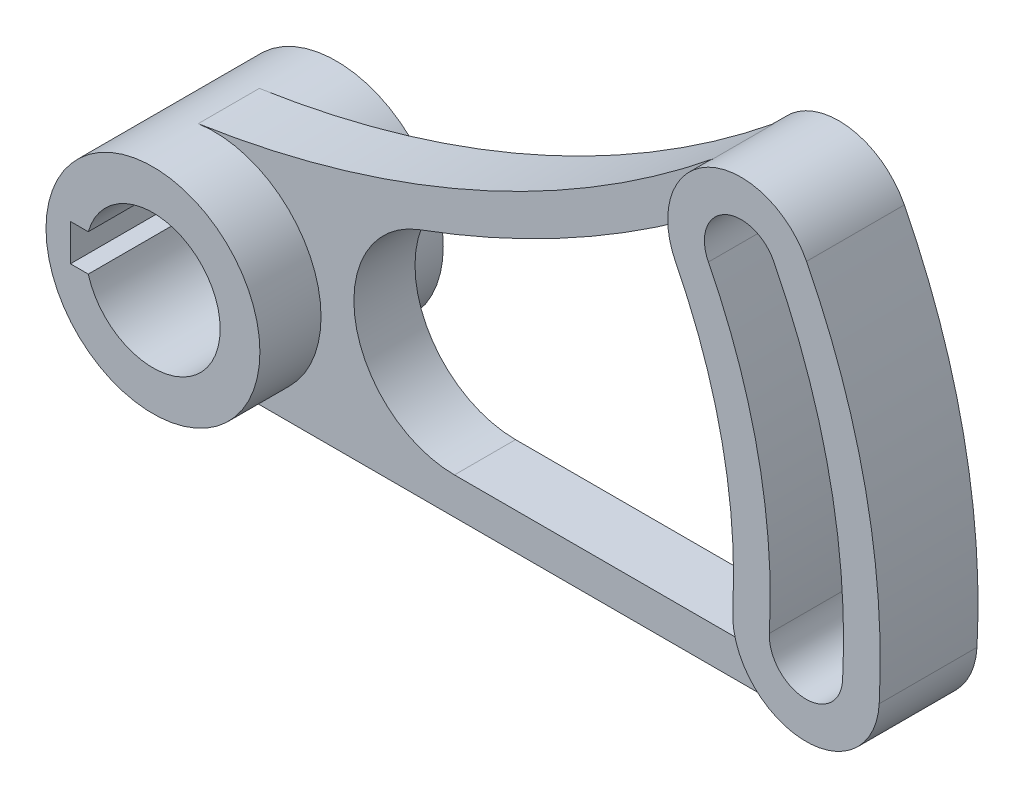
ISO-10303-21;
HEADER;
FILE_DESCRIPTION(('STEP AP214'),'2;1');
FILE_NAME('part.step','',(''),(''),'','','');
FILE_SCHEMA(('AUTOMOTIVE_DESIGN { 1 0 10303 214 1 1 1 1 }'));
ENDSEC;
DATA;
#1=APPLICATION_CONTEXT('core data for automotive mechanical design processes');
#2=APPLICATION_PROTOCOL_DEFINITION('international standard','automotive_design',2000,#1);
#3=PRODUCT_CONTEXT('',#1,'mechanical');
#4=PRODUCT('Part','Part','',(#3));
#5=PRODUCT_RELATED_PRODUCT_CATEGORY('part','',(#4));
#6=PRODUCT_DEFINITION_FORMATION('','',#4);
#7=PRODUCT_DEFINITION_CONTEXT('part definition',#1,'design');
#8=PRODUCT_DEFINITION('design','',#6,#7);
#9=PRODUCT_DEFINITION_SHAPE('','',#8);
#10=(LENGTH_UNIT() NAMED_UNIT(*) SI_UNIT(.MILLI.,.METRE.));
#11=(NAMED_UNIT(*) PLANE_ANGLE_UNIT() SI_UNIT($,.RADIAN.));
#12=(NAMED_UNIT(*) SI_UNIT($,.STERADIAN.) SOLID_ANGLE_UNIT());
#13=UNCERTAINTY_MEASURE_WITH_UNIT(LENGTH_MEASURE(1.E-05),#10,'distance_accuracy_value','');
#14=(GEOMETRIC_REPRESENTATION_CONTEXT(3) GLOBAL_UNCERTAINTY_ASSIGNED_CONTEXT((#13)) GLOBAL_UNIT_ASSIGNED_CONTEXT((#10,
#11,#12)) REPRESENTATION_CONTEXT('',''));
#15=CARTESIAN_POINT('',(0.,0.,0.));
#16=DIRECTION('',(0.,0.,1.));
#17=DIRECTION('',(1.,0.,0.));
#18=AXIS2_PLACEMENT_3D('',#15,#16,#17);
#19=CARTESIAN_POINT('',(0.,0.,15.));
#20=DIRECTION('',(0.,0.,-1.));
#21=DIRECTION('',(-1.,0.,0.));
#22=AXIS2_PLACEMENT_3D('',#19,#20,#21);
#23=CYLINDRICAL_SURFACE('',#22,11.);
#24=CARTESIAN_POINT('',(0.,0.,-15.));
#25=DIRECTION('',(0.,0.,1.));
#26=DIRECTION('',(1.,0.,0.));
#27=AXIS2_PLACEMENT_3D('',#24,#25,#26);
#28=CIRCLE('',#27,11.);
#29=CARTESIAN_POINT('',(-10.5830052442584,-3.,-15.));
#30=VERTEX_POINT('',#29);
#31=CARTESIAN_POINT('',(-10.5830052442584,3.,-15.));
#32=VERTEX_POINT('',#31);
#33=EDGE_CURVE('E298',#30,#32,#28,.T.);
#34=ORIENTED_EDGE('',*,*,#33,.F.);
#35=DIRECTION('',(0.,0.,-1.));
#36=VECTOR('',#35,1.);
#37=CARTESIAN_POINT('',(-10.5830052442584,-3.,15.));
#38=LINE('',#37,#36);
#39=CARTESIAN_POINT('',(-10.5830052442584,-3.,15.));
#40=VERTEX_POINT('',#39);
#41=EDGE_CURVE('E11',#40,#30,#38,.T.);
#42=ORIENTED_EDGE('',*,*,#41,.F.);
#43=CARTESIAN_POINT('',(0.,0.,15.));
#44=DIRECTION('',(0.,0.,1.));
#45=DIRECTION('',(1.,0.,0.));
#46=AXIS2_PLACEMENT_3D('',#43,#44,#45);
#47=CIRCLE('',#46,11.);
#48=CARTESIAN_POINT('',(-10.5830052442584,3.,15.));
#49=VERTEX_POINT('',#48);
#50=EDGE_CURVE('E299',#40,#49,#47,.T.);
#51=ORIENTED_EDGE('',*,*,#50,.T.);
#52=DIRECTION('',(0.,0.,-1.));
#53=VECTOR('',#52,1.);
#54=CARTESIAN_POINT('',(-10.5830052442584,3.,15.));
#55=LINE('',#54,#53);
#56=EDGE_CURVE('E319',#49,#32,#55,.T.);
#57=ORIENTED_EDGE('',*,*,#56,.T.);
#58=EDGE_LOOP('',(#34,#42,#51,#57));
#59=FACE_BOUND('',#58,.T.);
#60=ADVANCED_FACE('F38',(#59),#23,.F.);
#61=CARTESIAN_POINT('',(0.,-3.,15.));
#62=DIRECTION('',(0.,1.,0.));
#63=DIRECTION('',(0.,0.,1.));
#64=AXIS2_PLACEMENT_3D('',#61,#62,#63);
#65=PLANE('',#64);
#66=DIRECTION('',(1.,0.,0.));
#67=VECTOR('',#66,1.);
#68=CARTESIAN_POINT('',(0.,-3.,-15.));
#69=LINE('',#68,#67);
#70=CARTESIAN_POINT('',(-13.5,-3.,-15.));
#71=VERTEX_POINT('',#70);
#72=EDGE_CURVE('E323',#71,#30,#69,.T.);
#73=ORIENTED_EDGE('',*,*,#72,.F.);
#74=DIRECTION('',(0.,0.,-1.));
#75=VECTOR('',#74,1.);
#76=CARTESIAN_POINT('',(-13.5,-3.,15.));
#77=LINE('',#76,#75);
#78=CARTESIAN_POINT('',(-13.5,-3.,15.));
#79=VERTEX_POINT('',#78);
#80=EDGE_CURVE('E46',#79,#71,#77,.T.);
#81=ORIENTED_EDGE('',*,*,#80,.F.);
#82=DIRECTION('',(1.,0.,0.));
#83=VECTOR('',#82,1.);
#84=CARTESIAN_POINT('',(0.,-3.,15.));
#85=LINE('',#84,#83);
#86=EDGE_CURVE('E303',#79,#40,#85,.T.);
#87=ORIENTED_EDGE('',*,*,#86,.T.);
#88=ORIENTED_EDGE('',*,*,#41,.T.);
#89=EDGE_LOOP('',(#73,#81,#87,#88));
#90=FACE_BOUND('',#89,.T.);
#91=ADVANCED_FACE('F351',(#90),#65,.T.);
#92=CARTESIAN_POINT('',(-13.5,0.,15.));
#93=DIRECTION('',(1.,0.,0.));
#94=DIRECTION('',(0.,0.,-1.));
#95=AXIS2_PLACEMENT_3D('',#92,#93,#94);
#96=PLANE('',#95);
#97=DIRECTION('',(0.,-1.,0.));
#98=VECTOR('',#97,1.);
#99=CARTESIAN_POINT('',(-13.5,0.,-15.));
#100=LINE('',#99,#98);
#101=CARTESIAN_POINT('',(-13.5,3.,-15.));
#102=VERTEX_POINT('',#101);
#103=EDGE_CURVE('E327',#102,#71,#100,.T.);
#104=ORIENTED_EDGE('',*,*,#103,.F.);
#105=DIRECTION('',(0.,0.,-1.));
#106=VECTOR('',#105,1.);
#107=CARTESIAN_POINT('',(-13.5,3.,15.));
#108=LINE('',#107,#106);
#109=CARTESIAN_POINT('',(-13.5,3.,15.));
#110=VERTEX_POINT('',#109);
#111=EDGE_CURVE('E340',#110,#102,#108,.T.);
#112=ORIENTED_EDGE('',*,*,#111,.F.);
#113=DIRECTION('',(0.,-1.,0.));
#114=VECTOR('',#113,1.);
#115=CARTESIAN_POINT('',(-13.5,0.,15.));
#116=LINE('',#115,#114);
#117=EDGE_CURVE('E308',#110,#79,#116,.T.);
#118=ORIENTED_EDGE('',*,*,#117,.T.);
#119=ORIENTED_EDGE('',*,*,#80,.T.);
#120=EDGE_LOOP('',(#104,#112,#118,#119));
#121=FACE_BOUND('',#120,.T.);
#122=ADVANCED_FACE('F347',(#121),#96,.T.);
#123=CARTESIAN_POINT('',(0.,3.,15.));
#124=DIRECTION('',(0.,1.,0.));
#125=DIRECTION('',(0.,0.,1.));
#126=AXIS2_PLACEMENT_3D('',#123,#124,#125);
#127=PLANE('',#126);
#128=DIRECTION('',(1.,0.,0.));
#129=VECTOR('',#128,1.);
#130=CARTESIAN_POINT('',(0.,3.,-15.));
#131=LINE('',#130,#129);
#132=EDGE_CURVE('E331',#102,#32,#131,.T.);
#133=ORIENTED_EDGE('',*,*,#132,.T.);
#134=ORIENTED_EDGE('',*,*,#56,.F.);
#135=DIRECTION('',(1.,0.,0.));
#136=VECTOR('',#135,1.);
#137=CARTESIAN_POINT('',(0.,3.,15.));
#138=LINE('',#137,#136);
#139=EDGE_CURVE('E312',#110,#49,#138,.T.);
#140=ORIENTED_EDGE('',*,*,#139,.F.);
#141=ORIENTED_EDGE('',*,*,#111,.T.);
#142=EDGE_LOOP('',(#133,#134,#140,#141));
#143=FACE_BOUND('',#142,.T.);
#144=ADVANCED_FACE('F359',(#143),#127,.F.);
#145=CARTESIAN_POINT('',(0.,0.,15.));
#146=DIRECTION('',(0.,0.,-1.));
#147=DIRECTION('',(-1.,0.,0.));
#148=AXIS2_PLACEMENT_3D('',#145,#146,#147);
#149=CYLINDRICAL_SURFACE('',#148,17.5);
#150=DIRECTION('',(0.,0.,-1.));
#151=VECTOR('',#150,1.);
#152=CARTESIAN_POINT('',(0.,-17.5,5.));
#153=LINE('',#152,#151);
#154=CARTESIAN_POINT('',(0.,-17.5,5.));
#155=VERTEX_POINT('',#154);
#156=CARTESIAN_POINT('',(0.,-17.5,-5.));
#157=VERTEX_POINT('',#156);
#158=EDGE_CURVE('E58',#155,#157,#153,.T.);
#159=ORIENTED_EDGE('',*,*,#158,.F.);
#160=CARTESIAN_POINT('',(0.,0.,5.));
#161=DIRECTION('',(0.,0.,1.));
#162=DIRECTION('',(1.,0.,0.));
#163=AXIS2_PLACEMENT_3D('',#160,#161,#162);
#164=CIRCLE('',#163,17.5);
#165=CARTESIAN_POINT('',(-2.59842598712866,17.3060157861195,5.));
#166=VERTEX_POINT('',#165);
#167=EDGE_CURVE('E53',#155,#166,#164,.T.);
#168=ORIENTED_EDGE('',*,*,#167,.T.);
#169=DIRECTION('',(0.,0.,-1.));
#170=VECTOR('',#169,1.);
#171=CARTESIAN_POINT('',(-2.59842598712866,17.3060157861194,5.));
#172=LINE('',#171,#170);
#173=CARTESIAN_POINT('',(-2.59842598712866,17.3060157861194,-5.));
#174=VERTEX_POINT('',#173);
#175=EDGE_CURVE('E282',#166,#174,#172,.T.);
#176=ORIENTED_EDGE('',*,*,#175,.T.);
#177=CARTESIAN_POINT('',(0.,0.,-5.));
#178=DIRECTION('',(0.,0.,1.));
#179=DIRECTION('',(1.,0.,0.));
#180=AXIS2_PLACEMENT_3D('',#177,#178,#179);
#181=CIRCLE('',#180,17.5);
#182=EDGE_CURVE('E263',#157,#174,#181,.T.);
#183=ORIENTED_EDGE('',*,*,#182,.F.);
#184=EDGE_LOOP('',(#159,#168,#176,#183));
#185=FACE_BOUND('',#184,.T.);
#186=CARTESIAN_POINT('',(0.,0.,15.));
#187=DIRECTION('',(0.,0.,1.));
#188=DIRECTION('',(1.,0.,0.));
#189=AXIS2_PLACEMENT_3D('',#186,#187,#188);
#190=CIRCLE('',#189,17.5);
#191=CARTESIAN_POINT('',(17.5,0.,15.));
#192=VERTEX_POINT('',#191);
#193=EDGE_CURVE('E315',#192,#192,#190,.T.);
#194=ORIENTED_EDGE('',*,*,#193,.F.);
#195=EDGE_LOOP('',(#194));
#196=FACE_BOUND('',#195,.T.);
#197=CARTESIAN_POINT('',(0.,0.,-15.));
#198=DIRECTION('',(0.,0.,1.));
#199=DIRECTION('',(1.,0.,0.));
#200=AXIS2_PLACEMENT_3D('',#197,#198,#199);
#201=CIRCLE('',#200,17.5);
#202=CARTESIAN_POINT('',(17.5,0.,-15.));
#203=VERTEX_POINT('',#202);
#204=EDGE_CURVE('E304',#203,#203,#201,.T.);
#205=ORIENTED_EDGE('',*,*,#204,.T.);
#206=EDGE_LOOP('',(#205));
#207=FACE_BOUND('',#206,.T.);
#208=ADVANCED_FACE('F377',(#185,#196,#207),#149,.T.);
#209=CARTESIAN_POINT('',(0.,0.,15.));
#210=DIRECTION('',(0.,0.,1.));
#211=DIRECTION('',(1.,0.,0.));
#212=AXIS2_PLACEMENT_3D('',#209,#210,#211);
#213=PLANE('',#212);
#214=ORIENTED_EDGE('',*,*,#50,.F.);
#215=ORIENTED_EDGE('',*,*,#86,.F.);
#216=ORIENTED_EDGE('',*,*,#117,.F.);
#217=ORIENTED_EDGE('',*,*,#139,.T.);
#218=EDGE_LOOP('',(#214,#215,#216,#217));
#219=FACE_BOUND('',#218,.T.);
#220=ORIENTED_EDGE('',*,*,#193,.T.);
#221=EDGE_LOOP('',(#220));
#222=FACE_BOUND('',#221,.T.);
#223=ADVANCED_FACE('F363',(#219,#222),#213,.T.);
#224=CARTESIAN_POINT('',(0.,0.,-15.));
#225=DIRECTION('',(0.,0.,1.));
#226=DIRECTION('',(1.,0.,0.));
#227=AXIS2_PLACEMENT_3D('',#224,#225,#226);
#228=PLANE('',#227);
#229=ORIENTED_EDGE('',*,*,#33,.T.);
#230=ORIENTED_EDGE('',*,*,#132,.F.);
#231=ORIENTED_EDGE('',*,*,#103,.T.);
#232=ORIENTED_EDGE('',*,*,#72,.T.);
#233=EDGE_LOOP('',(#229,#230,#231,#232));
#234=FACE_BOUND('',#233,.T.);
#235=ORIENTED_EDGE('',*,*,#204,.F.);
#236=EDGE_LOOP('',(#235));
#237=FACE_BOUND('',#236,.T.);
#238=ADVANCED_FACE('F355',(#234,#237),#228,.F.);
#239=CARTESIAN_POINT('',(0.,-11.5,5.));
#240=DIRECTION('',(0.,1.,0.));
#241=DIRECTION('',(-1.,0.,0.));
#242=AXIS2_PLACEMENT_3D('',#239,#240,#241);
#243=PLANE('',#242);
#244=DIRECTION('',(1.,0.,0.));
#245=VECTOR('',#244,1.);
#246=CARTESIAN_POINT('',(0.,-11.5,-5.));
#247=LINE('',#246,#245);
#248=CARTESIAN_POINT('',(39.3305378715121,-11.5,-5.));
#249=VERTEX_POINT('',#248);
#250=CARTESIAN_POINT('',(89.4447864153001,-11.5,-5.));
#251=VERTEX_POINT('',#250);
#252=EDGE_CURVE('E242',#249,#251,#247,.T.);
#253=ORIENTED_EDGE('',*,*,#252,.F.);
#254=DIRECTION('',(0.,0.,-1.));
#255=VECTOR('',#254,1.);
#256=CARTESIAN_POINT('',(39.3305378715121,-11.5,5.));
#257=LINE('',#256,#255);
#258=CARTESIAN_POINT('',(39.3305378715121,-11.5,5.));
#259=VERTEX_POINT('',#258);
#260=EDGE_CURVE('E295',#259,#249,#257,.T.);
#261=ORIENTED_EDGE('',*,*,#260,.F.);
#262=DIRECTION('',(1.,0.,0.));
#263=VECTOR('',#262,1.);
#264=CARTESIAN_POINT('',(0.,-11.5,5.));
#265=LINE('',#264,#263);
#266=CARTESIAN_POINT('',(89.4447864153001,-11.5,5.));
#267=VERTEX_POINT('',#266);
#268=EDGE_CURVE('E214',#259,#267,#265,.T.);
#269=ORIENTED_EDGE('',*,*,#268,.T.);
#270=DIRECTION('',(0.,0.,-1.));
#271=VECTOR('',#270,1.);
#272=CARTESIAN_POINT('',(89.4447864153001,-11.5,5.));
#273=LINE('',#272,#271);
#274=EDGE_CURVE('E241',#267,#251,#273,.T.);
#275=ORIENTED_EDGE('',*,*,#274,.T.);
#276=EDGE_LOOP('',(#253,#261,#269,#275));
#277=FACE_BOUND('',#276,.T.);
#278=ADVANCED_FACE('F382',(#277),#243,.T.);
#279=CARTESIAN_POINT('',(39.3305378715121,4.95634805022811,5.));
#280=DIRECTION('',(0.,0.,-1.));
#281=DIRECTION('',(-1.,0.,0.));
#282=AXIS2_PLACEMENT_3D('',#279,#280,#281);
#283=CYLINDRICAL_SURFACE('',#282,16.4563480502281);
#284=CARTESIAN_POINT('',(39.3305378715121,4.95634805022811,-5.));
#285=DIRECTION('',(0.,0.,1.));
#286=DIRECTION('',(1.,0.,0.));
#287=AXIS2_PLACEMENT_3D('',#284,#285,#286);
#288=CIRCLE('',#287,16.4563480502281);
#289=CARTESIAN_POINT('',(33.6705342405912,20.4087184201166,-5.));
#290=VERTEX_POINT('',#289);
#291=EDGE_CURVE('E246',#249,#290,#288,.F.);
#292=ORIENTED_EDGE('',*,*,#291,.T.);
#293=DIRECTION('',(0.,0.,-1.));
#294=VECTOR('',#293,1.);
#295=CARTESIAN_POINT('',(33.6705342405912,20.4087184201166,5.));
#296=LINE('',#295,#294);
#297=CARTESIAN_POINT('',(33.6705342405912,20.4087184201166,5.));
#298=VERTEX_POINT('',#297);
#299=EDGE_CURVE('E292',#298,#290,#296,.T.);
#300=ORIENTED_EDGE('',*,*,#299,.F.);
#301=CARTESIAN_POINT('',(39.3305378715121,4.95634805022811,5.));
#302=DIRECTION('',(0.,0.,1.));
#303=DIRECTION('',(1.,0.,0.));
#304=AXIS2_PLACEMENT_3D('',#301,#302,#303);
#305=CIRCLE('',#304,16.4563480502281);
#306=EDGE_CURVE('E218',#259,#298,#305,.F.);
#307=ORIENTED_EDGE('',*,*,#306,.F.);
#308=ORIENTED_EDGE('',*,*,#260,.T.);
#309=EDGE_LOOP('',(#292,#300,#307,#308));
#310=FACE_BOUND('',#309,.T.);
#311=ADVANCED_FACE('F387',(#310),#283,.F.);
#312=CARTESIAN_POINT('',(-28.5826858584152,190.366173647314,5.));
#313=DIRECTION('',(0.,0.,-1.));
#314=DIRECTION('',(-1.,0.,0.));
#315=AXIS2_PLACEMENT_3D('',#312,#313,#314);
#316=CYLINDRICAL_SURFACE('',#315,181.);
#317=CARTESIAN_POINT('',(-28.5826858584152,190.366173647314,-5.));
#318=DIRECTION('',(0.,0.,1.));
#319=DIRECTION('',(1.,0.,0.));
#320=AXIS2_PLACEMENT_3D('',#317,#318,#319);
#321=CIRCLE('',#320,181.);
#322=CARTESIAN_POINT('',(77.3309090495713,43.5897776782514,-5.));
#323=VERTEX_POINT('',#322);
#324=EDGE_CURVE('E251',#323,#290,#321,.F.);
#325=ORIENTED_EDGE('',*,*,#324,.F.);
#326=DIRECTION('',(0.,0.,-1.));
#327=VECTOR('',#326,1.);
#328=CARTESIAN_POINT('',(77.3309090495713,43.5897776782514,5.));
#329=LINE('',#328,#327);
#330=CARTESIAN_POINT('',(77.3309090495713,43.5897776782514,5.));
#331=VERTEX_POINT('',#330);
#332=EDGE_CURVE('E289',#331,#323,#329,.T.);
#333=ORIENTED_EDGE('',*,*,#332,.F.);
#334=CARTESIAN_POINT('',(-28.5826858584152,190.366173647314,5.));
#335=DIRECTION('',(0.,0.,1.));
#336=DIRECTION('',(1.,0.,0.));
#337=AXIS2_PLACEMENT_3D('',#334,#335,#336);
#338=CIRCLE('',#337,181.);
#339=EDGE_CURVE('E222',#331,#298,#338,.F.);
#340=ORIENTED_EDGE('',*,*,#339,.T.);
#341=ORIENTED_EDGE('',*,*,#299,.T.);
#342=EDGE_LOOP('',(#325,#333,#340,#341));
#343=FACE_BOUND('',#342,.T.);
#344=ADVANCED_FACE('F391',(#343),#316,.T.);
#345=CARTESIAN_POINT('',(-28.5826858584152,190.366173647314,5.));
#346=DIRECTION('',(0.,0.,-1.));
#347=DIRECTION('',(-1.,0.,0.));
#348=AXIS2_PLACEMENT_3D('',#345,#346,#347);
#349=CYLINDRICAL_SURFACE('',#348,175.);
#350=CARTESIAN_POINT('',(-28.5826858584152,190.366173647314,-5.));
#351=DIRECTION('',(0.,0.,1.));
#352=DIRECTION('',(1.,0.,0.));
#353=AXIS2_PLACEMENT_3D('',#350,#351,#352);
#354=CIRCLE('',#353,175.);
#355=CARTESIAN_POINT('',(81.6695689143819,54.4638546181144,-5.));
#356=VERTEX_POINT('',#355);
#357=EDGE_CURVE('E259',#356,#174,#354,.F.);
#358=ORIENTED_EDGE('',*,*,#357,.T.);
#359=ORIENTED_EDGE('',*,*,#175,.F.);
#360=CARTESIAN_POINT('',(-28.5826858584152,190.366173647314,5.));
#361=DIRECTION('',(0.,0.,1.));
#362=DIRECTION('',(1.,0.,0.));
#363=AXIS2_PLACEMENT_3D('',#360,#361,#362);
#364=CIRCLE('',#363,175.);
#365=CARTESIAN_POINT('',(81.669568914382,54.4638546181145,5.));
#366=VERTEX_POINT('',#365);
#367=EDGE_CURVE('E229',#366,#166,#364,.F.);
#368=ORIENTED_EDGE('',*,*,#367,.F.);
#369=DIRECTION('',(0.,0.,-1.));
#370=VECTOR('',#369,1.);
#371=CARTESIAN_POINT('',(81.6695689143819,54.4638546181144,5.));
#372=LINE('',#371,#370);
#373=EDGE_CURVE('E285',#366,#356,#372,.T.);
#374=ORIENTED_EDGE('',*,*,#373,.T.);
#375=EDGE_LOOP('',(#358,#359,#368,#374));
#376=FACE_BOUND('',#375,.T.);
#377=ADVANCED_FACE('F395',(#376),#349,.F.);
#378=CARTESIAN_POINT('',(0.,-17.5,5.));
#379=DIRECTION('',(0.,1.,0.));
#380=DIRECTION('',(0.,0.,1.));
#381=AXIS2_PLACEMENT_3D('',#378,#379,#380);
#382=PLANE('',#381);
#383=DIRECTION('',(1.,0.,0.));
#384=VECTOR('',#383,1.);
#385=CARTESIAN_POINT('',(0.,-17.5,-5.));
#386=LINE('',#385,#384);
#387=CARTESIAN_POINT('',(99.1854323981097,-17.5,-5.));
#388=VERTEX_POINT('',#387);
#389=EDGE_CURVE('E267',#157,#388,#386,.T.);
#390=ORIENTED_EDGE('',*,*,#389,.T.);
#391=DIRECTION('',(0.,0.,-1.));
#392=VECTOR('',#391,1.);
#393=CARTESIAN_POINT('',(99.1854323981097,-17.5,5.));
#394=LINE('',#393,#392);
#395=CARTESIAN_POINT('',(99.1854323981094,-17.5,5.));
#396=VERTEX_POINT('',#395);
#397=EDGE_CURVE('E277',#396,#388,#394,.T.);
#398=ORIENTED_EDGE('',*,*,#397,.F.);
#399=DIRECTION('',(1.,0.,0.));
#400=VECTOR('',#399,1.);
#401=CARTESIAN_POINT('',(0.,-17.5,5.));
#402=LINE('',#401,#400);
#403=EDGE_CURVE('E234',#155,#396,#402,.T.);
#404=ORIENTED_EDGE('',*,*,#403,.F.);
#405=ORIENTED_EDGE('',*,*,#158,.T.);
#406=EDGE_LOOP('',(#390,#398,#404,#405));
#407=FACE_BOUND('',#406,.T.);
#408=ADVANCED_FACE('F399',(#407),#382,.F.);
#409=CARTESIAN_POINT('',(0.,0.,5.));
#410=DIRECTION('',(0.,0.,1.));
#411=DIRECTION('',(1.,0.,0.));
#412=AXIS2_PLACEMENT_3D('',#409,#410,#411);
#413=PLANE('',#412);
#414=ORIENTED_EDGE('',*,*,#268,.F.);
#415=ORIENTED_EDGE('',*,*,#306,.T.);
#416=ORIENTED_EDGE('',*,*,#339,.F.);
#417=CARTESIAN_POINT('',(89.2297235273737,45.1448384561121,5.));
#418=DIRECTION('',(0.,0.,1.));
#419=DIRECTION('',(1.,0.,0.));
#420=AXIS2_PLACEMENT_3D('',#417,#418,#419);
#421=CIRCLE('',#420,12.);
#422=EDGE_CURVE('E226',#366,#331,#421,.T.);
#423=ORIENTED_EDGE('',*,*,#422,.F.);
#424=ORIENTED_EDGE('',*,*,#367,.T.);
#425=ORIENTED_EDGE('',*,*,#167,.F.);
#426=ORIENTED_EDGE('',*,*,#403,.T.);
#427=CARTESIAN_POINT('',(99.8476265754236,-5.51828481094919,5.));
#428=DIRECTION('',(0.,0.,1.));
#429=DIRECTION('',(1.,0.,0.));
#430=AXIS2_PLACEMENT_3D('',#427,#428,#429);
#431=CIRCLE('',#430,12.);
#432=EDGE_CURVE('E238',#267,#396,#431,.T.);
#433=ORIENTED_EDGE('',*,*,#432,.F.);
#434=EDGE_LOOP('',(#414,#415,#416,#423,#424,#425,#426,#433));
#435=FACE_BOUND('',#434,.T.);
#436=ADVANCED_FACE('F403',(#435),#413,.T.);
#437=CARTESIAN_POINT('',(0.,0.,-5.));
#438=DIRECTION('',(0.,0.,1.));
#439=DIRECTION('',(1.,0.,0.));
#440=AXIS2_PLACEMENT_3D('',#437,#438,#439);
#441=PLANE('',#440);
#442=ORIENTED_EDGE('',*,*,#252,.T.);
#443=CARTESIAN_POINT('',(99.8476265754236,-5.51828481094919,-5.));
#444=DIRECTION('',(0.,0.,1.));
#445=DIRECTION('',(1.,0.,0.));
#446=AXIS2_PLACEMENT_3D('',#443,#444,#445);
#447=CIRCLE('',#446,12.);
#448=EDGE_CURVE('E219',#251,#388,#447,.T.);
#449=ORIENTED_EDGE('',*,*,#448,.T.);
#450=ORIENTED_EDGE('',*,*,#389,.F.);
#451=ORIENTED_EDGE('',*,*,#182,.T.);
#452=ORIENTED_EDGE('',*,*,#357,.F.);
#453=CARTESIAN_POINT('',(89.2297235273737,45.1448384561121,-5.));
#454=DIRECTION('',(0.,0.,1.));
#455=DIRECTION('',(1.,0.,0.));
#456=AXIS2_PLACEMENT_3D('',#453,#454,#455);
#457=CIRCLE('',#456,12.);
#458=EDGE_CURVE('E255',#356,#323,#457,.T.);
#459=ORIENTED_EDGE('',*,*,#458,.T.);
#460=ORIENTED_EDGE('',*,*,#324,.T.);
#461=ORIENTED_EDGE('',*,*,#291,.F.);
#462=EDGE_LOOP('',(#442,#449,#450,#451,#452,#459,#460,#461));
#463=FACE_BOUND('',#462,.T.);
#464=ADVANCED_FACE('F405',(#463),#441,.F.);
#465=CARTESIAN_POINT('',(99.8476265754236,-5.51828481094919,8.));
#466=DIRECTION('',(0.,0.,-1.));
#467=DIRECTION('',(-1.,0.,0.));
#468=AXIS2_PLACEMENT_3D('',#465,#466,#467);
#469=CYLINDRICAL_SURFACE('',#468,5.99999999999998);
#470=CARTESIAN_POINT('',(99.8476265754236,-5.51828481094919,-8.));
#471=DIRECTION('',(0.,0.,1.));
#472=DIRECTION('',(1.,0.,0.));
#473=AXIS2_PLACEMENT_3D('',#470,#471,#472);
#474=CIRCLE('',#473,5.99999999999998);
#475=CARTESIAN_POINT('',(93.8567689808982,-5.1871877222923,-8.));
#476=VERTEX_POINT('',#475);
#477=CARTESIAN_POINT('',(105.838484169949,-5.84938189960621,-8.));
#478=VERTEX_POINT('',#477);
#479=EDGE_CURVE('E640',#476,#478,#474,.T.);
#480=ORIENTED_EDGE('',*,*,#479,.F.);
#481=DIRECTION('',(0.,0.,-1.));
#482=VECTOR('',#481,1.);
#483=CARTESIAN_POINT('',(93.8567689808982,-5.1871877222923,8.));
#484=LINE('',#483,#482);
#485=CARTESIAN_POINT('',(93.8567689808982,-5.1871877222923,8.));
#486=VERTEX_POINT('',#485);
#487=EDGE_CURVE('E247',#486,#476,#484,.T.);
#488=ORIENTED_EDGE('',*,*,#487,.F.);
#489=CARTESIAN_POINT('',(99.8476265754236,-5.51828481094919,8.));
#490=DIRECTION('',(0.,0.,1.));
#491=DIRECTION('',(1.,0.,0.));
#492=AXIS2_PLACEMENT_3D('',#489,#490,#491);
#493=CIRCLE('',#492,5.99999999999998);
#494=CARTESIAN_POINT('',(105.838484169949,-5.84938189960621,8.));
#495=VERTEX_POINT('',#494);
#496=EDGE_CURVE('E699',#486,#495,#493,.T.);
#497=ORIENTED_EDGE('',*,*,#496,.T.);
#498=DIRECTION('',(0.,0.,-1.));
#499=VECTOR('',#498,1.);
#500=CARTESIAN_POINT('',(105.838484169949,-5.84938189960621,8.));
#501=LINE('',#500,#499);
#502=EDGE_CURVE('E203',#495,#478,#501,.T.);
#503=ORIENTED_EDGE('',*,*,#502,.T.);
#504=EDGE_LOOP('',(#480,#488,#497,#503));
#505=FACE_BOUND('',#504,.T.);
#506=ADVANCED_FACE('F408',(#505),#469,.F.);
#507=CARTESIAN_POINT('',(0.,0.,8.));
#508=DIRECTION('',(0.,0.,-1.));
#509=DIRECTION('',(-1.,0.,0.));
#510=AXIS2_PLACEMENT_3D('',#507,#508,#509);
#511=CYLINDRICAL_SURFACE('',#510,94.);
#512=CARTESIAN_POINT('',(0.,0.,-8.));
#513=DIRECTION('',(0.,0.,1.));
#514=DIRECTION('',(1.,0.,0.));
#515=AXIS2_PLACEMENT_3D('',#512,#513,#514);
#516=CIRCLE('',#515,94.);
#517=CARTESIAN_POINT('',(83.8759401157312,42.4361481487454,-8.));
#518=VERTEX_POINT('',#517);
#519=EDGE_CURVE('E644',#476,#518,#516,.T.);
#520=ORIENTED_EDGE('',*,*,#519,.T.);
#521=DIRECTION('',(0.,0.,-1.));
#522=VECTOR('',#521,1.);
#523=CARTESIAN_POINT('',(83.8759401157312,42.4361481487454,8.));
#524=LINE('',#523,#522);
#525=CARTESIAN_POINT('',(83.8759401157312,42.4361481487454,8.));
#526=VERTEX_POINT('',#525);
#527=EDGE_CURVE('E661',#526,#518,#524,.T.);
#528=ORIENTED_EDGE('',*,*,#527,.F.);
#529=CARTESIAN_POINT('',(0.,0.,8.));
#530=DIRECTION('',(0.,0.,1.));
#531=DIRECTION('',(1.,0.,0.));
#532=AXIS2_PLACEMENT_3D('',#529,#530,#531);
#533=CIRCLE('',#532,94.);
#534=EDGE_CURVE('E693',#486,#526,#533,.T.);
#535=ORIENTED_EDGE('',*,*,#534,.F.);
#536=ORIENTED_EDGE('',*,*,#487,.T.);
#537=EDGE_LOOP('',(#520,#528,#535,#536));
#538=FACE_BOUND('',#537,.T.);
#539=ADVANCED_FACE('F430',(#538),#511,.T.);
#540=CARTESIAN_POINT('',(89.2297235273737,45.1448384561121,8.));
#541=DIRECTION('',(0.,0.,-1.));
#542=DIRECTION('',(-1.,0.,0.));
#543=AXIS2_PLACEMENT_3D('',#540,#541,#542);
#544=CYLINDRICAL_SURFACE('',#543,6.);
#545=CARTESIAN_POINT('',(89.2297235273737,45.1448384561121,-8.));
#546=DIRECTION('',(0.,0.,1.));
#547=DIRECTION('',(1.,0.,0.));
#548=AXIS2_PLACEMENT_3D('',#545,#546,#547);
#549=CIRCLE('',#548,6.);
#550=CARTESIAN_POINT('',(94.583506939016,47.8535287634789,-8.));
#551=VERTEX_POINT('',#550);
#552=EDGE_CURVE('E652',#551,#518,#549,.T.);
#553=ORIENTED_EDGE('',*,*,#552,.F.);
#554=DIRECTION('',(0.,0.,-1.));
#555=VECTOR('',#554,1.);
#556=CARTESIAN_POINT('',(94.583506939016,47.8535287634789,8.));
#557=LINE('',#556,#555);
#558=CARTESIAN_POINT('',(94.583506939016,47.8535287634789,8.));
#559=VERTEX_POINT('',#558);
#560=EDGE_CURVE('E208',#559,#551,#557,.T.);
#561=ORIENTED_EDGE('',*,*,#560,.F.);
#562=CARTESIAN_POINT('',(89.2297235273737,45.1448384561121,8.));
#563=DIRECTION('',(0.,0.,1.));
#564=DIRECTION('',(1.,0.,0.));
#565=AXIS2_PLACEMENT_3D('',#562,#563,#564);
#566=CIRCLE('',#565,6.);
#567=EDGE_CURVE('E690',#559,#526,#566,.T.);
#568=ORIENTED_EDGE('',*,*,#567,.T.);
#569=ORIENTED_EDGE('',*,*,#527,.T.);
#570=EDGE_LOOP('',(#553,#561,#568,#569));
#571=FACE_BOUND('',#570,.T.);
#572=ADVANCED_FACE('F415',(#571),#544,.F.);
#573=CARTESIAN_POINT('',(0.,0.,8.));
#574=DIRECTION('',(0.,0.,-1.));
#575=DIRECTION('',(-1.,0.,0.));
#576=AXIS2_PLACEMENT_3D('',#573,#574,#575);
#577=CYLINDRICAL_SURFACE('',#576,112.);
#578=CARTESIAN_POINT('',(0.,0.,-8.));
#579=DIRECTION('',(0.,0.,1.));
#580=DIRECTION('',(1.,0.,0.));
#581=AXIS2_PLACEMENT_3D('',#578,#579,#580);
#582=CIRCLE('',#581,112.);
#583=CARTESIAN_POINT('',(111.829341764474,-6.18047898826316,-8.));
#584=VERTEX_POINT('',#583);
#585=CARTESIAN_POINT('',(99.9372903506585,50.5622190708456,-8.));
#586=VERTEX_POINT('',#585);
#587=EDGE_CURVE('E201',#584,#586,#582,.T.);
#588=ORIENTED_EDGE('',*,*,#587,.T.);
#589=DIRECTION('',(0.,0.,-1.));
#590=VECTOR('',#589,1.);
#591=CARTESIAN_POINT('',(99.9372903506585,50.5622190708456,8.));
#592=LINE('',#591,#590);
#593=CARTESIAN_POINT('',(99.9372903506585,50.5622190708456,8.));
#594=VERTEX_POINT('',#593);
#595=EDGE_CURVE('E178',#594,#586,#592,.T.);
#596=ORIENTED_EDGE('',*,*,#595,.F.);
#597=CARTESIAN_POINT('',(0.,0.,8.));
#598=DIRECTION('',(0.,0.,1.));
#599=DIRECTION('',(1.,0.,0.));
#600=AXIS2_PLACEMENT_3D('',#597,#598,#599);
#601=CIRCLE('',#600,112.);
#602=CARTESIAN_POINT('',(111.829341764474,-6.18047898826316,8.));
#603=VERTEX_POINT('',#602);
#604=EDGE_CURVE('E186',#603,#594,#601,.T.);
#605=ORIENTED_EDGE('',*,*,#604,.F.);
#606=DIRECTION('',(0.,0.,-1.));
#607=VECTOR('',#606,1.);
#608=CARTESIAN_POINT('',(111.829341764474,-6.18047898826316,8.));
#609=LINE('',#608,#607);
#610=EDGE_CURVE('E666',#603,#584,#609,.T.);
#611=ORIENTED_EDGE('',*,*,#610,.T.);
#612=EDGE_LOOP('',(#588,#596,#605,#611));
#613=FACE_BOUND('',#612,.T.);
#614=ADVANCED_FACE('F199',(#613),#577,.T.);
#615=CARTESIAN_POINT('',(89.2297235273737,45.1448384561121,8.));
#616=DIRECTION('',(0.,0.,-1.));
#617=DIRECTION('',(-1.,0.,0.));
#618=AXIS2_PLACEMENT_3D('',#615,#616,#617);
#619=CYLINDRICAL_SURFACE('',#618,12.);
#620=ORIENTED_EDGE('',*,*,#422,.T.);
#621=ORIENTED_EDGE('',*,*,#332,.T.);
#622=ORIENTED_EDGE('',*,*,#458,.F.);
#623=ORIENTED_EDGE('',*,*,#373,.F.);
#624=EDGE_LOOP('',(#620,#621,#622,#623));
#625=FACE_BOUND('',#624,.T.);
#626=CARTESIAN_POINT('',(89.2297235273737,45.1448384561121,-8.));
#627=DIRECTION('',(0.,0.,1.));
#628=DIRECTION('',(1.,0.,0.));
#629=AXIS2_PLACEMENT_3D('',#626,#627,#628);
#630=CIRCLE('',#629,12.);
#631=CARTESIAN_POINT('',(78.5221567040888,39.7274578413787,-8.));
#632=VERTEX_POINT('',#631);
#633=EDGE_CURVE('E678',#586,#632,#630,.T.);
#634=ORIENTED_EDGE('',*,*,#633,.T.);
#635=DIRECTION('',(0.,0.,-1.));
#636=VECTOR('',#635,1.);
#637=CARTESIAN_POINT('',(78.5221567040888,39.7274578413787,8.));
#638=LINE('',#637,#636);
#639=CARTESIAN_POINT('',(78.5221567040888,39.7274578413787,8.));
#640=VERTEX_POINT('',#639);
#641=EDGE_CURVE('E180',#640,#632,#638,.T.);
#642=ORIENTED_EDGE('',*,*,#641,.F.);
#643=CARTESIAN_POINT('',(89.2297235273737,45.1448384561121,8.));
#644=DIRECTION('',(0.,0.,1.));
#645=DIRECTION('',(1.,0.,0.));
#646=AXIS2_PLACEMENT_3D('',#643,#644,#645);
#647=CIRCLE('',#646,12.);
#648=EDGE_CURVE('E173',#594,#640,#647,.T.);
#649=ORIENTED_EDGE('',*,*,#648,.F.);
#650=ORIENTED_EDGE('',*,*,#595,.T.);
#651=EDGE_LOOP('',(#634,#642,#649,#650));
#652=FACE_BOUND('',#651,.T.);
#653=ADVANCED_FACE('F176',(#625,#652),#619,.T.);
#654=CARTESIAN_POINT('',(0.,0.,8.));
#655=DIRECTION('',(0.,0.,-1.));
#656=DIRECTION('',(-1.,0.,0.));
#657=AXIS2_PLACEMENT_3D('',#654,#655,#656);
#658=CYLINDRICAL_SURFACE('',#657,88.);
#659=CARTESIAN_POINT('',(0.,0.,-8.));
#660=DIRECTION('',(0.,0.,1.));
#661=DIRECTION('',(1.,0.,0.));
#662=AXIS2_PLACEMENT_3D('',#659,#660,#661);
#663=CIRCLE('',#662,88.);
#664=CARTESIAN_POINT('',(87.8659113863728,-4.85609063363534,-8.));
#665=VERTEX_POINT('',#664);
#666=EDGE_CURVE('E674',#665,#632,#663,.T.);
#667=ORIENTED_EDGE('',*,*,#666,.F.);
#668=DIRECTION('',(0.,0.,-1.));
#669=VECTOR('',#668,1.);
#670=CARTESIAN_POINT('',(87.8659113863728,-4.85609063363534,8.));
#671=LINE('',#670,#669);
#672=CARTESIAN_POINT('',(87.8659113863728,-4.85609063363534,8.));
#673=VERTEX_POINT('',#672);
#674=EDGE_CURVE('E210',#673,#665,#671,.T.);
#675=ORIENTED_EDGE('',*,*,#674,.F.);
#676=CARTESIAN_POINT('',(0.,0.,8.));
#677=DIRECTION('',(0.,0.,1.));
#678=DIRECTION('',(1.,0.,0.));
#679=AXIS2_PLACEMENT_3D('',#676,#677,#678);
#680=CIRCLE('',#679,88.);
#681=EDGE_CURVE('E185',#673,#640,#680,.T.);
#682=ORIENTED_EDGE('',*,*,#681,.T.);
#683=ORIENTED_EDGE('',*,*,#641,.T.);
#684=EDGE_LOOP('',(#667,#675,#682,#683));
#685=FACE_BOUND('',#684,.T.);
#686=ADVANCED_FACE('F418',(#685),#658,.F.);
#687=CARTESIAN_POINT('',(99.8476265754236,-5.51828481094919,8.));
#688=DIRECTION('',(0.,0.,-1.));
#689=DIRECTION('',(-1.,0.,0.));
#690=AXIS2_PLACEMENT_3D('',#687,#688,#689);
#691=CYLINDRICAL_SURFACE('',#690,12.);
#692=ORIENTED_EDGE('',*,*,#432,.T.);
#693=ORIENTED_EDGE('',*,*,#397,.T.);
#694=ORIENTED_EDGE('',*,*,#448,.F.);
#695=ORIENTED_EDGE('',*,*,#274,.F.);
#696=EDGE_LOOP('',(#692,#693,#694,#695));
#697=FACE_BOUND('',#696,.T.);
#698=CARTESIAN_POINT('',(99.8476265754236,-5.51828481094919,-8.));
#699=DIRECTION('',(0.,0.,1.));
#700=DIRECTION('',(1.,0.,0.));
#701=AXIS2_PLACEMENT_3D('',#698,#699,#700);
#702=CIRCLE('',#701,12.);
#703=EDGE_CURVE('E646',#665,#584,#702,.T.);
#704=ORIENTED_EDGE('',*,*,#703,.T.);
#705=ORIENTED_EDGE('',*,*,#610,.F.);
#706=CARTESIAN_POINT('',(99.8476265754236,-5.51828481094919,8.));
#707=DIRECTION('',(0.,0.,1.));
#708=DIRECTION('',(1.,0.,0.));
#709=AXIS2_PLACEMENT_3D('',#706,#707,#708);
#710=CIRCLE('',#709,12.);
#711=EDGE_CURVE('E192',#673,#603,#710,.T.);
#712=ORIENTED_EDGE('',*,*,#711,.F.);
#713=ORIENTED_EDGE('',*,*,#674,.T.);
#714=EDGE_LOOP('',(#704,#705,#712,#713));
#715=FACE_BOUND('',#714,.T.);
#716=ADVANCED_FACE('F422',(#697,#715),#691,.T.);
#717=CARTESIAN_POINT('',(0.,0.,8.));
#718=DIRECTION('',(0.,0.,-1.));
#719=DIRECTION('',(-1.,0.,0.));
#720=AXIS2_PLACEMENT_3D('',#717,#718,#719);
#721=CYLINDRICAL_SURFACE('',#720,106.);
#722=CARTESIAN_POINT('',(0.,0.,-8.));
#723=DIRECTION('',(0.,0.,1.));
#724=DIRECTION('',(1.,0.,0.));
#725=AXIS2_PLACEMENT_3D('',#722,#723,#724);
#726=CIRCLE('',#725,106.);
#727=EDGE_CURVE('E197',#478,#551,#726,.T.);
#728=ORIENTED_EDGE('',*,*,#727,.F.);
#729=ORIENTED_EDGE('',*,*,#502,.F.);
#730=CARTESIAN_POINT('',(0.,0.,8.));
#731=DIRECTION('',(0.,0.,1.));
#732=DIRECTION('',(1.,0.,0.));
#733=AXIS2_PLACEMENT_3D('',#730,#731,#732);
#734=CIRCLE('',#733,106.);
#735=EDGE_CURVE('E668',#495,#559,#734,.T.);
#736=ORIENTED_EDGE('',*,*,#735,.T.);
#737=ORIENTED_EDGE('',*,*,#560,.T.);
#738=EDGE_LOOP('',(#728,#729,#736,#737));
#739=FACE_BOUND('',#738,.T.);
#740=ADVANCED_FACE('F426',(#739),#721,.F.);
#741=CARTESIAN_POINT('',(0.,0.,8.));
#742=DIRECTION('',(0.,0.,1.));
#743=DIRECTION('',(1.,0.,0.));
#744=AXIS2_PLACEMENT_3D('',#741,#742,#743);
#745=PLANE('',#744);
#746=ORIENTED_EDGE('',*,*,#604,.T.);
#747=ORIENTED_EDGE('',*,*,#648,.T.);
#748=ORIENTED_EDGE('',*,*,#681,.F.);
#749=ORIENTED_EDGE('',*,*,#711,.T.);
#750=EDGE_LOOP('',(#746,#747,#748,#749));
#751=FACE_BOUND('',#750,.T.);
#752=ORIENTED_EDGE('',*,*,#496,.F.);
#753=ORIENTED_EDGE('',*,*,#534,.T.);
#754=ORIENTED_EDGE('',*,*,#567,.F.);
#755=ORIENTED_EDGE('',*,*,#735,.F.);
#756=EDGE_LOOP('',(#752,#753,#754,#755));
#757=FACE_BOUND('',#756,.T.);
#758=ADVANCED_FACE('F189',(#751,#757),#745,.T.);
#759=CARTESIAN_POINT('',(0.,0.,-8.));
#760=DIRECTION('',(0.,0.,1.));
#761=DIRECTION('',(1.,0.,0.));
#762=AXIS2_PLACEMENT_3D('',#759,#760,#761);
#763=PLANE('',#762);
#764=ORIENTED_EDGE('',*,*,#587,.F.);
#765=ORIENTED_EDGE('',*,*,#703,.F.);
#766=ORIENTED_EDGE('',*,*,#666,.T.);
#767=ORIENTED_EDGE('',*,*,#633,.F.);
#768=EDGE_LOOP('',(#764,#765,#766,#767));
#769=FACE_BOUND('',#768,.T.);
#770=ORIENTED_EDGE('',*,*,#479,.T.);
#771=ORIENTED_EDGE('',*,*,#727,.T.);
#772=ORIENTED_EDGE('',*,*,#552,.T.);
#773=ORIENTED_EDGE('',*,*,#519,.F.);
#774=EDGE_LOOP('',(#770,#771,#772,#773));
#775=FACE_BOUND('',#774,.T.);
#776=ADVANCED_FACE('F441',(#769,#775),#763,.F.);
#777=CLOSED_SHELL('',(#60,#91,#122,#144,#208,#223,#238,#278,#311,#344,#377,#408,#436,#464,#506,
#539,#572,#614,#653,#686,#716,#740,#758,#776));
#778=MANIFOLD_SOLID_BREP('B2',#777);
#779=ADVANCED_BREP_SHAPE_REPRESENTATION('',(#18,#778),#14);
#780=SHAPE_DEFINITION_REPRESENTATION(#9,#779);
ENDSEC;
END-ISO-10303-21;
